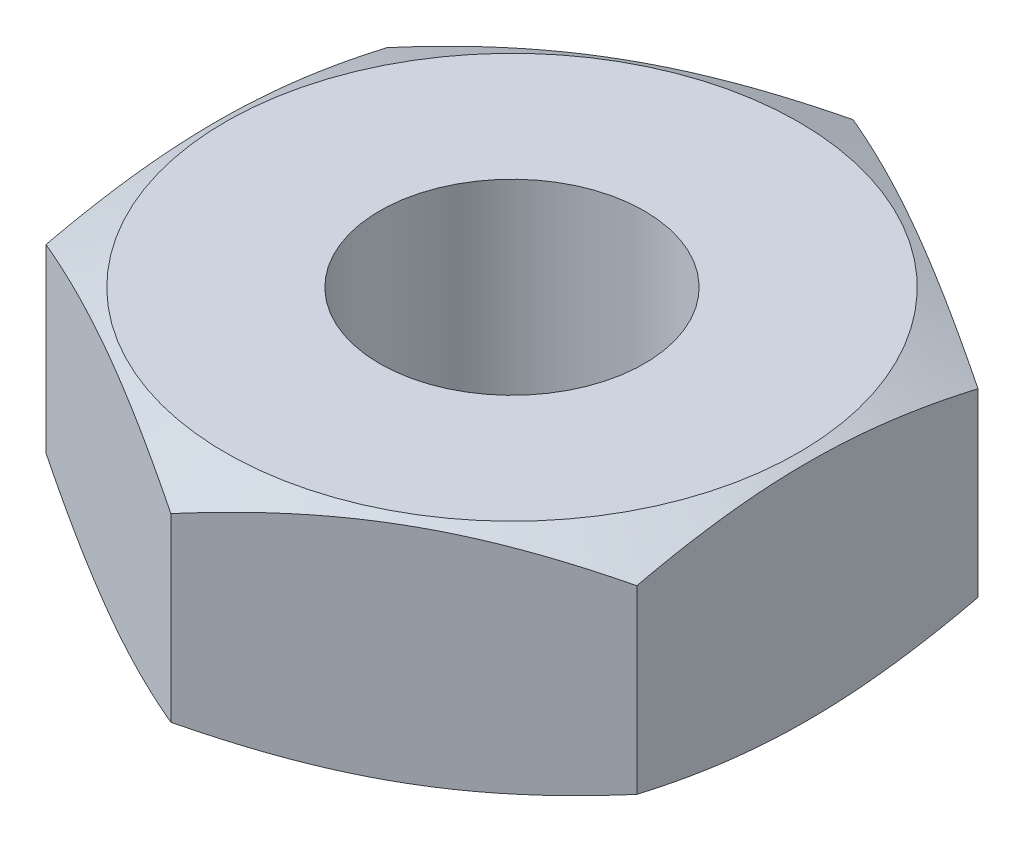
ISO-10303-21;
HEADER;
FILE_DESCRIPTION(('STEP AP214'),'2;1');
FILE_NAME('part.step','',(''),(''),'','','');
FILE_SCHEMA(('AUTOMOTIVE_DESIGN { 1 0 10303 214 1 1 1 1 }'));
ENDSEC;
DATA;
#1=APPLICATION_CONTEXT('core data for automotive mechanical design processes');
#2=APPLICATION_PROTOCOL_DEFINITION('international standard','automotive_design',2000,#1);
#3=PRODUCT_CONTEXT('',#1,'mechanical');
#4=PRODUCT('Part','Part','',(#3));
#5=PRODUCT_RELATED_PRODUCT_CATEGORY('part','',(#4));
#6=PRODUCT_DEFINITION_FORMATION('','',#4);
#7=PRODUCT_DEFINITION_CONTEXT('part definition',#1,'design');
#8=PRODUCT_DEFINITION('design','',#6,#7);
#9=PRODUCT_DEFINITION_SHAPE('','',#8);
#10=(LENGTH_UNIT() NAMED_UNIT(*) SI_UNIT(.MILLI.,.METRE.));
#11=(NAMED_UNIT(*) PLANE_ANGLE_UNIT() SI_UNIT($,.RADIAN.));
#12=(NAMED_UNIT(*) SI_UNIT($,.STERADIAN.) SOLID_ANGLE_UNIT());
#13=UNCERTAINTY_MEASURE_WITH_UNIT(LENGTH_MEASURE(1.E-05),#10,'distance_accuracy_value','');
#14=(GEOMETRIC_REPRESENTATION_CONTEXT(3) GLOBAL_UNCERTAINTY_ASSIGNED_CONTEXT((#13)) GLOBAL_UNIT_ASSIGNED_CONTEXT((#10,
#11,#12)) REPRESENTATION_CONTEXT('',''));
#15=CARTESIAN_POINT('',(0.,0.,0.));
#16=DIRECTION('',(0.,0.,1.));
#17=DIRECTION('',(1.,0.,0.));
#18=AXIS2_PLACEMENT_3D('',#15,#16,#17);
#19=CARTESIAN_POINT('',(3.07958633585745,0.,0.));
#20=DIRECTION('',(0.,-1.,0.));
#21=DIRECTION('',(0.,0.,-1.));
#22=AXIS2_PLACEMENT_3D('',#19,#20,#21);
#23=PLANE('',#22);
#24=CARTESIAN_POINT('',(0.,1.2490009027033E-13,0.));
#25=DIRECTION('',(0.,-1.,0.));
#26=DIRECTION('',(0.,0.,-1.));
#27=AXIS2_PLACEMENT_3D('',#24,#25,#26);
#28=CIRCLE('',#27,3.07958633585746);
#29=CARTESIAN_POINT('',(0.,1.0519894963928E-13,-3.07958633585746));
#30=VERTEX_POINT('',#29);
#31=EDGE_CURVE('E184',#30,#30,#28,.T.);
#32=ORIENTED_EDGE('',*,*,#31,.T.);
#33=EDGE_LOOP('',(#32));
#34=FACE_BOUND('',#33,.T.);
#35=CARTESIAN_POINT('',(0.,1.2490009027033E-13,0.));
#36=DIRECTION('',(0.,-1.,0.));
#37=DIRECTION('',(0.,0.,-1.));
#38=AXIS2_PLACEMENT_3D('',#35,#36,#37);
#39=CIRCLE('',#38,1.4224);
#40=CARTESIAN_POINT('',(0.,1.15800523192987E-13,-1.4224));
#41=VERTEX_POINT('',#40);
#42=EDGE_CURVE('E192',#41,#41,#39,.T.);
#43=ORIENTED_EDGE('',*,*,#42,.F.);
#44=EDGE_LOOP('',(#43));
#45=FACE_BOUND('',#44,.T.);
#46=ADVANCED_FACE('F26',(#34,#45),#23,.T.);
#47=CARTESIAN_POINT('',(0.,-24.8919999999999,-1.11022302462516E-13));
#48=DIRECTION('',(0.,-1.,0.));
#49=DIRECTION('',(0.,0.,-1.));
#50=AXIS2_PLACEMENT_3D('',#47,#48,#49);
#51=CYLINDRICAL_SURFACE('',#50,1.4224);
#52=ORIENTED_EDGE('',*,*,#42,.T.);
#53=EDGE_LOOP('',(#52));
#54=FACE_BOUND('',#53,.T.);
#55=CARTESIAN_POINT('',(-1.38777878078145E-13,2.48920000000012,2.77555756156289E-13));
#56=DIRECTION('',(0.,-1.,0.));
#57=DIRECTION('',(0.,0.,-1.));
#58=AXIS2_PLACEMENT_3D('',#55,#56,#57);
#59=CIRCLE('',#58,1.4224);
#60=CARTESIAN_POINT('',(-1.38383082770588E-13,2.48920000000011,-1.42239999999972));
#61=VERTEX_POINT('',#60);
#62=EDGE_CURVE('E190',#61,#61,#59,.T.);
#63=ORIENTED_EDGE('',*,*,#62,.F.);
#64=EDGE_LOOP('',(#63));
#65=FACE_BOUND('',#64,.T.);
#66=ADVANCED_FACE('F222',(#54,#65),#51,.F.);
#67=CARTESIAN_POINT('',(1.42239999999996,2.48920000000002,3.05311331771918E-13));
#68=DIRECTION('',(0.,1.,0.));
#69=DIRECTION('',(0.,0.,1.));
#70=AXIS2_PLACEMENT_3D('',#67,#68,#69);
#71=PLANE('',#70);
#72=ORIENTED_EDGE('',*,*,#62,.T.);
#73=EDGE_LOOP('',(#72));
#74=FACE_BOUND('',#73,.T.);
#75=CARTESIAN_POINT('',(-1.38777878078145E-13,2.48920000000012,2.77555756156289E-13));
#76=DIRECTION('',(0.,-1.,0.));
#77=DIRECTION('',(0.,0.,-1.));
#78=AXIS2_PLACEMENT_3D('',#75,#76,#77);
#79=CIRCLE('',#78,3.07958633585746);
#80=CARTESIAN_POINT('',(-1.37923121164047E-13,2.4892000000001,-3.07958633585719));
#81=VERTEX_POINT('',#80);
#82=EDGE_CURVE('E187',#81,#81,#79,.T.);
#83=ORIENTED_EDGE('',*,*,#82,.F.);
#84=EDGE_LOOP('',(#83));
#85=FACE_BOUND('',#84,.T.);
#86=ADVANCED_FACE('F227',(#74,#85),#71,.T.);
#87=CARTESIAN_POINT('',(-1.38777878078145E-13,2.21566958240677,2.77555756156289E-13));
#88=DIRECTION('',(0.,-1.,0.));
#89=DIRECTION('',(0.,0.,-1.));
#90=AXIS2_PLACEMENT_3D('',#87,#88,#89);
#91=CONICAL_SURFACE('',#90,3.66617420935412,1.1344640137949);
#92=CARTESIAN_POINT('',(3.17499999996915,1.22054135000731,-4.85407918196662));
#93=CARTESIAN_POINT('',(3.17499999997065,1.27618918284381,-4.71143932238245));
#94=CARTESIAN_POINT('',(3.17499999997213,1.33122756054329,-4.56855720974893));
#95=CARTESIAN_POINT('',(3.17499999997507,1.43973966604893,-4.28217998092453));
#96=CARTESIAN_POINT('',(3.17499999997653,1.49321319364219,-4.13868478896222));
#97=CARTESIAN_POINT('',(3.17499999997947,1.59841400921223,-3.85050019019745));
#98=CARTESIAN_POINT('',(3.17499999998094,1.65013474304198,-3.70580838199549));
#99=CARTESIAN_POINT('',(3.17499999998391,1.75114634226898,-3.41558149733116));
#100=CARTESIAN_POINT('',(3.17499999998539,1.80043729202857,-3.27004645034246));
#101=CARTESIAN_POINT('',(3.17499999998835,1.89532487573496,-2.97991427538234));
#102=CARTESIAN_POINT('',(3.17499999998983,1.94096194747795,-2.83533044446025));
#103=CARTESIAN_POINT('',(3.17499999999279,2.02847202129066,-2.54503070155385));
#104=CARTESIAN_POINT('',(3.17499999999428,2.07034525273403,-2.39931485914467));
#105=CARTESIAN_POINT('',(3.17499999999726,2.14930113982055,-2.10672082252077));
#106=CARTESIAN_POINT('',(3.17499999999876,2.18638822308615,-1.95984383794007));
#107=CARTESIAN_POINT('',(3.17500000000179,2.25460851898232,-1.66473138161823));
#108=CARTESIAN_POINT('',(3.17500000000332,2.28574256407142,-1.51649610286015));
#109=CARTESIAN_POINT('',(3.17500000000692,2.35072345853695,-1.16414340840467));
#110=CARTESIAN_POINT('',(3.17500000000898,2.3814006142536,-0.959409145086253));
#111=CARTESIAN_POINT('',(3.17500000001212,2.41462996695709,-0.650994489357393));
#112=CARTESIAN_POINT('',(3.17500000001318,2.42357502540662,-0.547984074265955));
#113=CARTESIAN_POINT('',(3.17500000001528,2.43692069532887,-0.341673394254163));
#114=CARTESIAN_POINT('',(3.17500000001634,2.4413218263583,-0.238373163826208));
#115=CARTESIAN_POINT('',(3.17500000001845,2.445426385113,-0.0312268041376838));
#116=CARTESIAN_POINT('',(3.17500000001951,2.44510916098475,0.0726197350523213));
#117=CARTESIAN_POINT('',(3.17500000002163,2.43973997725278,0.280181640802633));
#118=CARTESIAN_POINT('',(3.17500000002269,2.43468834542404,0.383897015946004));
#119=CARTESIAN_POINT('',(3.1750000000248,2.42003199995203,0.591025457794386));
#120=CARTESIAN_POINT('',(3.17500000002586,2.41042630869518,0.694438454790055));
#121=CARTESIAN_POINT('',(3.17500000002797,2.3869849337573,0.900771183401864));
#122=CARTESIAN_POINT('',(3.17500000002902,2.37314938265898,1.00369093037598));
#123=CARTESIAN_POINT('',(3.17500000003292,2.31471623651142,1.38452665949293));
#124=CARTESIAN_POINT('',(3.17500000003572,2.25798338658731,1.66061773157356));
#125=CARTESIAN_POINT('',(3.17500000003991,2.1583946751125,2.07113252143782));
#126=CARTESIAN_POINT('',(3.1750000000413,2.12275584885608,2.20745393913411));
#127=CARTESIAN_POINT('',(3.17500000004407,2.04755889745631,2.47901724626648));
#128=CARTESIAN_POINT('',(3.17500000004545,2.00800101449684,2.6142592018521));
#129=CARTESIAN_POINT('',(3.17500000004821,1.9255107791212,2.88451676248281));
#130=CARTESIAN_POINT('',(3.17500000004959,1.88256096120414,3.01952697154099));
#131=CARTESIAN_POINT('',(3.17500000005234,1.79409512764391,3.28870656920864));
#132=CARTESIAN_POINT('',(3.17500000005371,1.74857902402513,3.42287592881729));
#133=CARTESIAN_POINT('',(3.1750000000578,1.60899614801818,3.82416872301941));
#134=CARTESIAN_POINT('',(3.17500000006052,1.51185020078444,4.09021905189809));
#135=CARTESIAN_POINT('',(3.17500000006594,1.31175651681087,4.62120769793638));
#136=CARTESIAN_POINT('',(3.17500000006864,1.20878898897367,4.88613846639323));
#137=CARTESIAN_POINT('',(3.17500000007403,0.999046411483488,5.41452447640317));
#138=CARTESIAN_POINT('',(3.17500000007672,0.892270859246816,5.67797951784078));
#139=CARTESIAN_POINT('',(3.17500000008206,0.677417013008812,6.20041664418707));
#140=CARTESIAN_POINT('',(3.17500000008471,0.569372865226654,6.4594128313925));
#141=CARTESIAN_POINT('',(3.17500000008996,0.351338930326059,6.97651804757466));
#142=CARTESIAN_POINT('',(3.17500000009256,0.241349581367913,7.23462726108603));
#143=CARTESIAN_POINT('',(3.1750000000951,0.130699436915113,7.49244750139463));
#144=B_SPLINE_CURVE_WITH_KNOTS('',3,(#92,#93,#94,#95,#96,#97,#98,#99,#100,#101,#102,#103,#104,
#105,#106,#107,#108,#109,#110,#111,#112,#113,#114,#115,#116,#117,#118,#119,#120,#121,#122,#123,
#124,#125,#126,#127,#128,#129,#130,#131,#132,#133,#134,#135,#136,#137,#138,#139,#140,#141,#142,
#143),.UNSPECIFIED.,.F.,.F.,(4,2,2,2,2,2,2,2,2,2,2,2,2,2,2,2,2,2,2,2,2,2,2,2,2,4),(0.,
0.459336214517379,0.918730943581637,1.37968734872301,1.84062773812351,2.2954332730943,
2.75021107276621,3.20456509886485,3.65885554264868,4.27923488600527,4.58934471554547,
4.89941908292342,5.21085101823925,5.52226139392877,5.83373864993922,6.14520614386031,
6.98949562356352,7.41218620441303,7.83485068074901,8.25985456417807,8.68487302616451,
9.53446313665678,10.3871390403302,11.239927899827,12.0818059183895,12.9234966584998),.UNSPECIFIED.);
#145=CARTESIAN_POINT('',(3.17500000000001,2.21566958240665,-1.83308710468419));
#146=VERTEX_POINT('',#145);
#147=CARTESIAN_POINT('',(3.17500000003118,2.21566958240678,1.83308710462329));
#148=VERTEX_POINT('',#147);
#149=EDGE_CURVE('E176',#146,#148,#144,.T.);
#150=ORIENTED_EDGE('',*,*,#149,.F.);
#151=CARTESIAN_POINT('',(-0.000200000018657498,2.21561573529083,-3.66628967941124));
#152=CARTESIAN_POINT('',(0.0958205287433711,2.24146788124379,-3.61085220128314));
#153=CARTESIAN_POINT('',(0.192195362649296,2.26565998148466,-3.55521016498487));
#154=CARTESIAN_POINT('',(0.385668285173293,2.31014782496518,-3.4435085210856));
#155=CARTESIAN_POINT('',(0.482766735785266,2.33044146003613,-3.38744870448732));
#156=CARTESIAN_POINT('',(0.677689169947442,2.36654386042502,-3.27491018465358));
#157=CARTESIAN_POINT('',(0.775513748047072,2.38234840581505,-3.21843113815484));
#158=CARTESIAN_POINT('',(0.971664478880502,2.40888922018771,-3.10518346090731));
#159=CARTESIAN_POINT('',(1.06999053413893,2.41962643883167,-3.04841488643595));
#160=CARTESIAN_POINT('',(1.26493848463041,2.43543943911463,-2.93586163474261));
#161=CARTESIAN_POINT('',(1.36155343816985,2.44062800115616,-2.8800809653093));
#162=CARTESIAN_POINT('',(1.55489483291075,2.44551688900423,-2.76845525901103));
#163=CARTESIAN_POINT('',(1.65162128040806,2.44521688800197,-2.71261021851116));
#164=CARTESIAN_POINT('',(1.84485278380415,2.43914377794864,-2.60104795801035));
#165=CARTESIAN_POINT('',(1.94135796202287,2.43337577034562,-2.54533066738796));
#166=CARTESIAN_POINT('',(2.13401570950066,2.41661500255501,-2.43409966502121));
#167=CARTESIAN_POINT('',(2.23016831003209,2.4056227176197,-2.37858593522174));
#168=CARTESIAN_POINT('',(2.39719776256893,2.38229383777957,-2.2821514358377));
#169=CARTESIAN_POINT('',(2.46819033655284,2.37103724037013,-2.24116385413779));
#170=CARTESIAN_POINT('',(2.60985089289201,2.34609260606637,-2.15937609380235));
#171=CARTESIAN_POINT('',(2.68051888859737,2.33240467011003,-2.11857590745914));
#172=CARTESIAN_POINT('',(2.82207640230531,2.30270182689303,-2.03684763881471));
#173=CARTESIAN_POINT('',(2.89296307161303,2.28666895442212,-1.99592120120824));
#174=CARTESIAN_POINT('',(3.03436150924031,2.25259287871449,-1.91428477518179));
#175=CARTESIAN_POINT('',(3.10487333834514,2.23455001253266,-1.87357475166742));
#176=CARTESIAN_POINT('',(3.17520000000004,2.21561573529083,-1.83297163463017));
#177=B_SPLINE_CURVE_WITH_KNOTS('',3,(#151,#152,#153,#154,#155,#156,#157,#158,#159,#160,#161,
#162,#163,#164,#165,#166,#167,#168,#169,#170,#171,#172,#173,#174,#175,#176),.UNSPECIFIED.,.F.,
.F.,(4,2,2,2,2,2,2,2,2,2,2,2,4),(0.,0.34156632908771,0.683316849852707,1.02538757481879,
1.36739416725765,1.70230880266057,2.03724338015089,2.37186578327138,2.70645775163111,
2.95465467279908,3.20284129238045,3.45303996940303,3.70319675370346),.UNSPECIFIED.);
#178=CARTESIAN_POINT('',(-1.87350135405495E-11,2.21566958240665,-3.66617420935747));
#179=VERTEX_POINT('',#178);
#180=EDGE_CURVE('E171',#179,#146,#177,.T.);
#181=ORIENTED_EDGE('',*,*,#180,.F.);
#182=CARTESIAN_POINT('',(-3.17520000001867,2.21561573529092,-1.8329716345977));
#183=CARTESIAN_POINT('',(-3.07917947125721,2.2414678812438,-1.88840911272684));
#184=CARTESIAN_POINT('',(-2.98280463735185,2.26565998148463,-1.94405114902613));
#185=CARTESIAN_POINT('',(-2.78933171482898,2.31014782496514,-2.0557527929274));
#186=CARTESIAN_POINT('',(-2.69223326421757,2.3304414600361,-2.11181260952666));
#187=CARTESIAN_POINT('',(-2.49731083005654,2.366543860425,-2.22435112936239));
#188=CARTESIAN_POINT('',(-2.39948625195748,2.38234840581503,-2.28083017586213));
#189=CARTESIAN_POINT('',(-2.2033355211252,2.40888922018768,-2.39407785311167));
#190=CARTESIAN_POINT('',(-2.10500946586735,2.41962643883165,-2.45084642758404));
#191=CARTESIAN_POINT('',(-1.91006151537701,2.43543943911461,-2.56339967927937));
#192=CARTESIAN_POINT('',(-1.81344656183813,2.44062800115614,-2.61918034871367));
#193=CARTESIAN_POINT('',(-1.62010516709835,2.4455168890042,-2.73080605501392));
#194=CARTESIAN_POINT('',(-1.5233787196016,2.44521688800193,-2.78665109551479));
#195=CARTESIAN_POINT('',(-1.33014721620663,2.43914377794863,-2.89821335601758));
#196=CARTESIAN_POINT('',(-1.23364203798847,2.43337577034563,-2.95393064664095));
#197=CARTESIAN_POINT('',(-1.0409842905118,2.41661500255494,-3.06516164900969));
#198=CARTESIAN_POINT('',(-0.944831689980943,2.40562271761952,-3.12067537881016));
#199=CARTESIAN_POINT('',(-0.777802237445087,2.38229383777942,-3.2171098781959));
#200=CARTESIAN_POINT('',(-0.706809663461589,2.37103724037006,-3.25809745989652));
#201=CARTESIAN_POINT('',(-0.56514910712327,2.34609260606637,-3.33988522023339));
#202=CARTESIAN_POINT('',(-0.494481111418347,2.33240467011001,-3.38068540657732));
#203=CARTESIAN_POINT('',(-0.352923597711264,2.30270182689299,-3.46241367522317));
#204=CARTESIAN_POINT('',(-0.282036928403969,2.28666895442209,-3.50334011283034));
#205=CARTESIAN_POINT('',(-0.14063849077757,2.25259287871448,-3.58497653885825));
#206=CARTESIAN_POINT('',(-0.0701266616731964,2.23455001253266,-3.62568656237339));
#207=CARTESIAN_POINT('',(0.000199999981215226,2.21561573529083,-3.66628967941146));
#208=B_SPLINE_CURVE_WITH_KNOTS('',3,(#182,#183,#184,#185,#186,#187,#188,#189,#190,#191,#192,
#193,#194,#195,#196,#197,#198,#199,#200,#201,#202,#203,#204,#205,#206,#207),.UNSPECIFIED.,.F.,
.F.,(4,2,2,2,2,2,2,2,2,2,2,2,4),(0.,0.341566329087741,0.683316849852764,1.02538757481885,
1.36739416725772,1.70230880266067,2.03724338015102,2.37186578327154,2.70645775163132,
2.95465467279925,3.20284129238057,3.4530399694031,3.70319675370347),.UNSPECIFIED.);
#209=CARTESIAN_POINT('',(-3.1750000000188,2.21566958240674,-1.83308710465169));
#210=VERTEX_POINT('',#209);
#211=EDGE_CURVE('E102',#210,#179,#208,.T.);
#212=ORIENTED_EDGE('',*,*,#211,.F.);
#213=CARTESIAN_POINT('',(-3.17500000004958,1.22054135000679,-4.8540791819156));
#214=CARTESIAN_POINT('',(-3.17500000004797,1.27618918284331,-4.71143932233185));
#215=CARTESIAN_POINT('',(-3.17500000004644,1.33122756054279,-4.56855720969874));
#216=CARTESIAN_POINT('',(-3.17500000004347,1.43973966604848,-4.28217998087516));
#217=CARTESIAN_POINT('',(-3.17500000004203,1.49321319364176,-4.13868478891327));
#218=CARTESIAN_POINT('',(-3.1750000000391,1.5984140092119,-3.85050019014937));
#219=CARTESIAN_POINT('',(-3.17500000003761,1.65013474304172,-3.70580838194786));
#220=CARTESIAN_POINT('',(-3.17500000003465,1.7511463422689,-3.41558149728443));
#221=CARTESIAN_POINT('',(-3.17500000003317,1.80043729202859,-3.27004645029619));
#222=CARTESIAN_POINT('',(-3.1750000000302,1.89532487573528,-2.97991427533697));
#223=CARTESIAN_POINT('',(-3.17500000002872,1.94096194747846,-2.8353304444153));
#224=CARTESIAN_POINT('',(-3.17500000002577,2.0284720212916,-2.54503070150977));
#225=CARTESIAN_POINT('',(-3.17500000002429,2.07034525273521,-2.39931485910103));
#226=CARTESIAN_POINT('',(-3.17500000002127,2.14930113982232,-2.10672082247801));
#227=CARTESIAN_POINT('',(-3.17500000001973,2.18638822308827,-1.95984383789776));
#228=CARTESIAN_POINT('',(-3.17500000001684,2.25460851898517,-1.66473138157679));
#229=CARTESIAN_POINT('',(-3.1750000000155,2.28574256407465,-1.51649610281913));
#230=CARTESIAN_POINT('',(-3.17500000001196,2.3507234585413,-1.16414340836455));
#231=CARTESIAN_POINT('',(-3.17500000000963,2.38140061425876,-0.959409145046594));
#232=CARTESIAN_POINT('',(-3.1750000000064,2.41462996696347,-0.65099448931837));
#233=CARTESIAN_POINT('',(-3.17500000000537,2.4235750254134,-0.547984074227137));
#234=CARTESIAN_POINT('',(-3.17500000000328,2.43692069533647,-0.341673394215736));
#235=CARTESIAN_POINT('',(-3.17500000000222,2.44132182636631,-0.238373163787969));
#236=CARTESIAN_POINT('',(-3.1750000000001,2.44542638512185,-0.0312268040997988));
#237=CARTESIAN_POINT('',(-3.17499999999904,2.44510916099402,0.0726197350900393));
#238=CARTESIAN_POINT('',(-3.17499999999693,2.43973997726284,0.280181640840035));
#239=CARTESIAN_POINT('',(-3.17499999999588,2.43468834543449,0.383897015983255));
#240=CARTESIAN_POINT('',(-3.17499999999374,2.42003199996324,0.591025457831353));
#241=CARTESIAN_POINT('',(-3.17499999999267,2.41042630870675,0.694438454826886));
#242=CARTESIAN_POINT('',(-3.17499999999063,2.38698493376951,0.900771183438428));
#243=CARTESIAN_POINT('',(-3.17499999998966,2.37314938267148,1.00369093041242));
#244=CARTESIAN_POINT('',(-3.17499999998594,2.31471623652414,1.38452665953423));
#245=CARTESIAN_POINT('',(-3.17499999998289,2.2579833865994,1.6606177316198));
#246=CARTESIAN_POINT('',(-3.17499999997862,2.15839467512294,2.07113252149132));
#247=CARTESIAN_POINT('',(-3.17499999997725,2.12275584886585,2.20745393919));
#248=CARTESIAN_POINT('',(-3.17499999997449,2.04755889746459,2.47901724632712));
#249=CARTESIAN_POINT('',(-3.17499999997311,2.00800101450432,2.61425920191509));
#250=CARTESIAN_POINT('',(-3.17499999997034,1.92551077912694,2.88451676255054));
#251=CARTESIAN_POINT('',(-3.17499999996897,1.88256096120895,3.01952697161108));
#252=CARTESIAN_POINT('',(-3.17499999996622,1.7940951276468,3.28870656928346));
#253=CARTESIAN_POINT('',(-3.17499999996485,1.74857902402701,3.42287592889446));
#254=CARTESIAN_POINT('',(-3.17499999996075,1.60899614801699,3.82416872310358));
#255=CARTESIAN_POINT('',(-3.17499999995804,1.51185020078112,4.09021905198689));
#256=CARTESIAN_POINT('',(-3.17499999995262,1.31175651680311,4.62120769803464));
#257=CARTESIAN_POINT('',(-3.17499999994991,1.20878898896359,4.88613846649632));
#258=CARTESIAN_POINT('',(-3.17499999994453,0.999046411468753,5.4145244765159));
#259=CARTESIAN_POINT('',(-3.17499999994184,0.892270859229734,5.67797951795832));
#260=CARTESIAN_POINT('',(-3.17499999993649,0.677417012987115,6.20041664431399));
#261=CARTESIAN_POINT('',(-3.17499999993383,0.569372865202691,6.45941283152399));
#262=CARTESIAN_POINT('',(-3.17499999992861,0.351338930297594,6.97651804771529));
#263=CARTESIAN_POINT('',(-3.17499999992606,0.241349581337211,7.23462726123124));
#264=CARTESIAN_POINT('',(-3.17499999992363,0.130699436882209,7.49244750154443));
#265=B_SPLINE_CURVE_WITH_KNOTS('',3,(#213,#214,#215,#216,#217,#218,#219,#220,#221,#222,#223,
#224,#225,#226,#227,#228,#229,#230,#231,#232,#233,#234,#235,#236,#237,#238,#239,#240,#241,#242,
#243,#244,#245,#246,#247,#248,#249,#250,#251,#252,#253,#254,#255,#256,#257,#258,#259,#260,#261,
#262,#263,#264),.UNSPECIFIED.,.F.,.F.,(4,2,2,2,2,2,2,2,2,2,2,2,2,2,2,2,2,2,2,2,2,2,2,2,2,4),(0.,
0.459336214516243,0.918730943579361,1.37968734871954,1.84062773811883,2.29543327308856,
2.75021107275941,3.20456509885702,3.65885554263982,4.27923488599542,4.58934471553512,
4.89941908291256,5.21085101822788,5.5222613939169,5.83373864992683,6.14520614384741,
6.98949562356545,7.41218620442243,7.83485068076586,8.25985456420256,8.68487302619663,
9.53446313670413,10.3871390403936,11.2399278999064,12.0818059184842,12.9234966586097),.UNSPECIFIED.);
#266=CARTESIAN_POINT('',(-3.17499999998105,2.21566958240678,1.833087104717));
#267=VERTEX_POINT('',#266);
#268=EDGE_CURVE('E100',#267,#210,#265,.F.);
#269=ORIENTED_EDGE('',*,*,#268,.F.);
#270=CARTESIAN_POINT('',(0.000200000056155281,2.21561573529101,3.66628967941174));
#271=CARTESIAN_POINT('',(-0.0958205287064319,2.24146788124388,3.61085220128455));
#272=CARTESIAN_POINT('',(-0.192195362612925,2.26565998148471,3.55521016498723));
#273=CARTESIAN_POINT('',(-0.385668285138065,2.31014782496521,3.44350852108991));
#274=CARTESIAN_POINT('',(-0.482766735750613,2.33044146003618,3.38744870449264));
#275=CARTESIAN_POINT('',(-0.677689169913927,2.36654386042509,3.2749101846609));
#276=CARTESIAN_POINT('',(-0.775513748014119,2.38234840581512,3.21843113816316));
#277=CARTESIAN_POINT('',(-0.971664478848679,2.40888922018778,3.10518346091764));
#278=CARTESIAN_POINT('',(-1.06999053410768,2.41962643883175,3.04841488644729));
#279=CARTESIAN_POINT('',(-1.2649384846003,2.43543943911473,2.93586163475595));
#280=CARTESIAN_POINT('',(-1.36155343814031,2.44062800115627,2.88008096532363));
#281=CARTESIAN_POINT('',(-1.55489483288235,2.44551688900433,2.76845525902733));
#282=CARTESIAN_POINT('',(-1.65162128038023,2.44521688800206,2.71261021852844));
#283=CARTESIAN_POINT('',(-1.84485278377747,2.43914377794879,2.6010479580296));
#284=CARTESIAN_POINT('',(-1.94135796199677,2.43337577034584,2.5453306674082));
#285=CARTESIAN_POINT('',(-2.13401570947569,2.41661500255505,2.4340996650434));
#286=CARTESIAN_POINT('',(-2.23016831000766,2.40562271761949,2.37858593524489));
#287=CARTESIAN_POINT('',(-2.39719776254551,2.38229383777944,2.28215143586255));
#288=CARTESIAN_POINT('',(-2.46819033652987,2.3710372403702,2.24116385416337));
#289=CARTESIAN_POINT('',(-2.60985089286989,2.34609260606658,2.15937609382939));
#290=CARTESIAN_POINT('',(-2.68051888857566,2.33240467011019,2.11857590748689));
#291=CARTESIAN_POINT('',(-2.82207640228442,2.30270182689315,2.03684763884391));
#292=CARTESIAN_POINT('',(-2.89296307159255,2.28666895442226,1.99592120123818));
#293=CARTESIAN_POINT('',(-3.03436150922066,2.25259287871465,1.91428477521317));
#294=CARTESIAN_POINT('',(-3.1048733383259,2.23455001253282,1.87357475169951));
#295=CARTESIAN_POINT('',(-3.1751999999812,2.21561573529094,1.83297163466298));
#296=B_SPLINE_CURVE_WITH_KNOTS('',3,(#270,#271,#272,#273,#274,#275,#276,#277,#278,#279,#280,
#281,#282,#283,#284,#285,#286,#287,#288,#289,#290,#291,#292,#293,#294,#295),.UNSPECIFIED.,.F.,
.F.,(4,2,2,2,2,2,2,2,2,2,2,2,4),(0.,0.34156632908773,0.683316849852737,1.02538757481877,
1.36739416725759,1.70230880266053,2.03724338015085,2.37186578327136,2.70645775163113,
2.9546546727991,3.20284129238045,3.45303996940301,3.70319675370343),.UNSPECIFIED.);
#297=CARTESIAN_POINT('',(5.62605517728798E-11,2.21566958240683,3.66617420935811));
#298=VERTEX_POINT('',#297);
#299=EDGE_CURVE('E84',#298,#267,#296,.T.);
#300=ORIENTED_EDGE('',*,*,#299,.F.);
#301=CARTESIAN_POINT('',(3.17520000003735,2.21561573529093,1.83297163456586));
#302=CARTESIAN_POINT('',(3.07917947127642,2.24146788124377,1.88840911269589));
#303=CARTESIAN_POINT('',(2.98280463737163,2.26565998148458,1.94405114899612));
#304=CARTESIAN_POINT('',(2.78933171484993,2.31014782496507,2.05575279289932));
#305=CARTESIAN_POINT('',(2.69223326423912,2.33044146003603,2.11181260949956));
#306=CARTESIAN_POINT('',(2.49731083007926,2.36654386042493,2.22435112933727));
#307=CARTESIAN_POINT('',(2.39948625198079,2.38234840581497,2.28083017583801));
#308=CARTESIAN_POINT('',(2.20333552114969,2.40888922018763,2.39407785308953));
#309=CARTESIAN_POINT('',(2.10500946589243,2.4196264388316,2.4508464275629));
#310=CARTESIAN_POINT('',(1.91006151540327,2.43543943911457,2.5633996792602));
#311=CARTESIAN_POINT('',(1.81344656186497,2.4406280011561,2.61918034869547));
#312=CARTESIAN_POINT('',(1.62010516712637,2.44551688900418,2.73080605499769));
#313=CARTESIAN_POINT('',(1.52337871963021,2.44521688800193,2.78665109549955));
#314=CARTESIAN_POINT('',(1.33014721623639,2.43914377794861,2.89821335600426));
#315=CARTESIAN_POINT('',(1.23364203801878,2.43337577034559,2.95393064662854));
#316=CARTESIAN_POINT('',(1.04098429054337,2.41661500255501,3.06516164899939));
#317=CARTESIAN_POINT('',(0.944831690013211,2.40562271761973,3.12067537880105));
#318=CARTESIAN_POINT('',(0.777802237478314,2.3822938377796,3.21710987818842));
#319=CARTESIAN_POINT('',(0.706809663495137,2.37103724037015,3.2580974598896));
#320=CARTESIAN_POINT('',(0.565149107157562,2.34609260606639,3.3398852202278));
#321=CARTESIAN_POINT('',(0.494481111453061,2.33240467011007,3.38068540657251));
#322=CARTESIAN_POINT('',(0.352923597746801,2.30270182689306,3.46241367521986));
#323=CARTESIAN_POINT('',(0.282036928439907,2.28666895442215,3.50334011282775));
#324=CARTESIAN_POINT('',(0.140638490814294,2.25259287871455,3.5849765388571));
#325=CARTESIAN_POINT('',(0.0701266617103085,2.23455001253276,3.62568656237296));
#326=CARTESIAN_POINT('',(-0.000199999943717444,2.21561573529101,3.66628967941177));
#327=B_SPLINE_CURVE_WITH_KNOTS('',3,(#301,#302,#303,#304,#305,#306,#307,#308,#309,#310,#311,
#312,#313,#314,#315,#316,#317,#318,#319,#320,#321,#322,#323,#324,#325,#326),.UNSPECIFIED.,.F.,
.F.,(4,2,2,2,2,2,2,2,2,2,2,2,4),(0.,0.341566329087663,0.683316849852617,1.02538757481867,
1.36739416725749,1.70230880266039,2.03724338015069,2.37186578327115,2.70645775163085,
2.95465467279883,3.2028412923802,3.45303996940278,3.70319675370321),.UNSPECIFIED.);
#328=EDGE_CURVE('E79',#148,#298,#327,.T.);
#329=ORIENTED_EDGE('',*,*,#328,.F.);
#330=EDGE_LOOP('',(#150,#181,#212,#269,#300,#329));
#331=FACE_BOUND('',#330,.T.);
#332=ORIENTED_EDGE('',*,*,#82,.T.);
#333=EDGE_LOOP('',(#332));
#334=FACE_BOUND('',#333,.T.);
#335=ADVANCED_FACE('F97',(#331,#334),#91,.T.);
#336=CARTESIAN_POINT('',(0.,1.2490009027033E-13,0.));
#337=DIRECTION('',(0.,1.,0.));
#338=DIRECTION('',(0.,0.,1.));
#339=AXIS2_PLACEMENT_3D('',#336,#337,#338);
#340=CONICAL_SURFACE('',#339,3.07958633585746,1.1344640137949);
#341=CARTESIAN_POINT('',(3.17499999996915,1.26865864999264,-4.85407918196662));
#342=CARTESIAN_POINT('',(3.17499999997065,1.21301081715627,-4.71143932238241));
#343=CARTESIAN_POINT('',(3.17499999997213,1.15797243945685,-4.56855720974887));
#344=CARTESIAN_POINT('',(3.17499999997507,1.04946033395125,-4.28217998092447));
#345=CARTESIAN_POINT('',(3.17499999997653,0.995986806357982,-4.13868478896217));
#346=CARTESIAN_POINT('',(3.17499999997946,0.890785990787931,-3.85050019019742));
#347=CARTESIAN_POINT('',(3.17499999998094,0.839065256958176,-3.70580838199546));
#348=CARTESIAN_POINT('',(3.1749999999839,0.738053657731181,-3.41558149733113));
#349=CARTESIAN_POINT('',(3.17499999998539,0.688762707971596,-3.27004645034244));
#350=CARTESIAN_POINT('',(3.17499999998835,0.593875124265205,-2.97991427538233));
#351=CARTESIAN_POINT('',(3.17499999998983,0.548238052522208,-2.83533044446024));
#352=CARTESIAN_POINT('',(3.17499999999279,0.460727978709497,-2.54503070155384));
#353=CARTESIAN_POINT('',(3.17499999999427,0.418854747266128,-2.39931485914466));
#354=CARTESIAN_POINT('',(3.17499999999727,0.339898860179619,-2.10672082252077));
#355=CARTESIAN_POINT('',(3.17499999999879,0.302811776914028,-1.95984383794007));
#356=CARTESIAN_POINT('',(3.17500000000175,0.234591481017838,-1.66473138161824));
#357=CARTESIAN_POINT('',(3.17500000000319,0.203457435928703,-1.51649610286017));
#358=CARTESIAN_POINT('',(3.17500000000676,0.138476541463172,-1.16414340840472));
#359=CARTESIAN_POINT('',(3.17500000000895,0.107799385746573,-0.959409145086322));
#360=CARTESIAN_POINT('',(3.17500000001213,0.0745700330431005,-0.650994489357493));
#361=CARTESIAN_POINT('',(3.17500000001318,0.0656249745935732,-0.547984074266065));
#362=CARTESIAN_POINT('',(3.17500000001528,0.0522793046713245,-0.341673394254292));
#363=CARTESIAN_POINT('',(3.17500000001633,0.0478781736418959,-0.238373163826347));
#364=CARTESIAN_POINT('',(3.17500000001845,0.0437736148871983,-0.0312268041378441));
#365=CARTESIAN_POINT('',(3.17500000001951,0.0440908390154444,0.0726197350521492));
#366=CARTESIAN_POINT('',(3.17500000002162,0.0494600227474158,0.280181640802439));
#367=CARTESIAN_POINT('',(3.17500000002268,0.0545116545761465,0.383897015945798));
#368=CARTESIAN_POINT('',(3.17500000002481,0.069168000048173,0.591025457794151));
#369=CARTESIAN_POINT('',(3.17500000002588,0.078773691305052,0.694438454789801));
#370=CARTESIAN_POINT('',(3.17500000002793,0.102215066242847,0.900771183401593));
#371=CARTESIAN_POINT('',(3.17500000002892,0.11605061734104,1.00369093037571));
#372=CARTESIAN_POINT('',(3.17500000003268,0.17448376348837,1.38452665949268));
#373=CARTESIAN_POINT('',(3.17500000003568,0.231216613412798,1.66061773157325));
#374=CARTESIAN_POINT('',(3.17500000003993,0.330805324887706,2.07113252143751));
#375=CARTESIAN_POINT('',(3.1750000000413,0.366444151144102,2.20745393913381));
#376=CARTESIAN_POINT('',(3.17500000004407,0.441641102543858,2.47901724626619));
#377=CARTESIAN_POINT('',(3.17500000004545,0.481198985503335,2.61425920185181));
#378=CARTESIAN_POINT('',(3.17500000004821,0.563689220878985,2.88451676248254));
#379=CARTESIAN_POINT('',(3.17500000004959,0.606639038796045,3.01952697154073));
#380=CARTESIAN_POINT('',(3.17500000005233,0.695104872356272,3.28870656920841));
#381=CARTESIAN_POINT('',(3.1750000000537,0.740620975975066,3.42287592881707));
#382=CARTESIAN_POINT('',(3.1750000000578,0.88020385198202,3.82416872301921));
#383=CARTESIAN_POINT('',(3.17500000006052,0.977349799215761,4.09021905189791));
#384=CARTESIAN_POINT('',(3.17500000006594,1.17744348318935,4.62120769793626));
#385=CARTESIAN_POINT('',(3.17500000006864,1.28041101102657,4.88613846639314));
#386=CARTESIAN_POINT('',(3.17500000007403,1.49015358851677,5.41452447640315));
#387=CARTESIAN_POINT('',(3.17500000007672,1.59692914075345,5.6779795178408));
#388=CARTESIAN_POINT('',(3.17500000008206,1.81178298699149,6.20041664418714));
#389=CARTESIAN_POINT('',(3.1750000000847,1.91982713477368,6.45941283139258));
#390=CARTESIAN_POINT('',(3.17500000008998,2.13786106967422,6.9765180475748));
#391=CARTESIAN_POINT('',(3.1750000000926,2.24785041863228,7.23462726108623));
#392=CARTESIAN_POINT('',(3.17500000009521,2.35850056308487,7.49244750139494));
#393=B_SPLINE_CURVE_WITH_KNOTS('',3,(#341,#342,#343,#344,#345,#346,#347,#348,#349,#350,#351,
#352,#353,#354,#355,#356,#357,#358,#359,#360,#361,#362,#363,#364,#365,#366,#367,#368,#369,#370,
#371,#372,#373,#374,#375,#376,#377,#378,#379,#380,#381,#382,#383,#384,#385,#386,#387,#388,#389,
#390,#391,#392),.UNSPECIFIED.,.F.,.F.,(4,2,2,2,2,2,2,2,2,2,2,2,2,2,2,2,2,2,2,2,2,2,2,2,2,4),(0.,
0.459336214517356,0.918730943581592,1.37968734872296,1.84062773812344,2.29543327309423,
2.75021107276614,3.20456509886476,3.65885554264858,4.2792348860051,4.58934471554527,
4.89941908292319,5.21085101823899,5.52226139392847,5.83373864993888,6.14520614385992,
6.98949562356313,7.41218620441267,7.83485068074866,8.25985456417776,8.68487302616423,
9.53446313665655,10.3871390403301,11.239927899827,12.0818059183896,12.9234966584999),.UNSPECIFIED.);
#394=CARTESIAN_POINT('',(3.17500000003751,0.273530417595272,1.83308710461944));
#395=VERTEX_POINT('',#394);
#396=CARTESIAN_POINT('',(3.17500000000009,0.273530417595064,-1.83308710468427));
#397=VERTEX_POINT('',#396);
#398=EDGE_CURVE('E11',#395,#397,#393,.F.);
#399=ORIENTED_EDGE('',*,*,#398,.F.);
#400=CARTESIAN_POINT('',(-0.000199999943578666,0.273584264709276,3.66628967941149));
#401=CARTESIAN_POINT('',(0.0958205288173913,0.247732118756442,3.61085220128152));
#402=CARTESIAN_POINT('',(0.192195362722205,0.223540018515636,3.55521016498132));
#403=CARTESIAN_POINT('',(0.385668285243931,0.17905217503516,3.44350852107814));
#404=CARTESIAN_POINT('',(0.482766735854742,0.158758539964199,3.38744870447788));
#405=CARTESIAN_POINT('',(0.677689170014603,0.122656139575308,3.27491018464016));
#406=CARTESIAN_POINT('',(0.775513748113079,0.106851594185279,3.21843113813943));
#407=CARTESIAN_POINT('',(0.971664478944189,0.0803107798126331,3.1051834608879));
#408=CARTESIAN_POINT('',(1.06999053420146,0.0695735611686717,3.04841488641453));
#409=CARTESIAN_POINT('',(1.26493848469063,0.0537605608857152,2.93586163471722));
#410=CARTESIAN_POINT('',(1.36155343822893,0.0485719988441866,2.88008096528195));
#411=CARTESIAN_POINT('',(1.55489483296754,0.0436831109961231,2.76845525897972));
#412=CARTESIAN_POINT('',(1.65162128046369,0.0439831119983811,2.71261021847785));
#413=CARTESIAN_POINT('',(1.84485278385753,0.0500562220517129,2.60104795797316));
#414=CARTESIAN_POINT('',(1.94135796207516,0.0558242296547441,2.5453306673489));
#415=CARTESIAN_POINT('',(2.13401570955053,0.0725849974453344,2.43409966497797));
#416=CARTESIAN_POINT('',(2.23016831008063,0.083577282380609,2.3785859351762));
#417=CARTESIAN_POINT('',(2.39719776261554,0.10690616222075,2.28215143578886));
#418=CARTESIAN_POINT('',(2.46819033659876,0.118162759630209,2.24116385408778));
#419=CARTESIAN_POINT('',(2.60985089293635,0.143107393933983,2.15937609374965));
#420=CARTESIAN_POINT('',(2.68051888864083,0.156795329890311,2.11857590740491));
#421=CARTESIAN_POINT('',(2.82207640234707,0.186498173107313,2.03684763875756));
#422=CARTESIAN_POINT('',(2.89296307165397,0.202531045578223,1.99592120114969));
#423=CARTESIAN_POINT('',(3.03436150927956,0.236607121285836,1.91428477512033));
#424=CARTESIAN_POINT('',(3.10487333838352,0.254649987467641,1.87357475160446));
#425=CARTESIAN_POINT('',(3.17520000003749,0.273584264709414,1.83297163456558));
#426=B_SPLINE_CURVE_WITH_KNOTS('',3,(#400,#401,#402,#403,#404,#405,#406,#407,#408,#409,#410,
#411,#412,#413,#414,#415,#416,#417,#418,#419,#420,#421,#422,#423,#424,#425),.UNSPECIFIED.,.F.,
.F.,(4,2,2,2,2,2,2,2,2,2,2,2,4),(0.,0.341566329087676,0.683316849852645,1.02538757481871,
1.36739416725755,1.70230880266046,2.03724338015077,2.37186578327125,2.70645775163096,
2.95465467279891,3.20284129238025,3.45303996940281,3.70319675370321),.UNSPECIFIED.);
#427=CARTESIAN_POINT('',(6.23390228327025E-11,0.273530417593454,3.66617420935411));
#428=VERTEX_POINT('',#427);
#429=EDGE_CURVE('E135',#428,#395,#426,.T.);
#430=ORIENTED_EDGE('',*,*,#429,.F.);
#431=CARTESIAN_POINT('',(-3.17519999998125,0.273584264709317,1.83297163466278));
#432=CARTESIAN_POINT('',(-3.07917947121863,0.247732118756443,1.88840911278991));
#433=CARTESIAN_POINT('',(-2.98280463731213,0.223540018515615,1.94405114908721));
#434=CARTESIAN_POINT('',(-2.78933171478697,0.179052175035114,2.05575279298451));
#435=CARTESIAN_POINT('',(-2.69223326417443,0.158758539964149,2.1118126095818));
#436=CARTESIAN_POINT('',(-2.49731083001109,0.122656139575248,2.22435112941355));
#437=CARTESIAN_POINT('',(-2.39948625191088,0.106851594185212,2.2808301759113));
#438=CARTESIAN_POINT('',(-2.20333552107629,0.0803107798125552,2.39407785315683));
#439=CARTESIAN_POINT('',(-2.10500946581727,0.0695735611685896,2.4508464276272));
#440=CARTESIAN_POINT('',(-1.91006151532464,0.0537605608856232,2.56339967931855));
#441=CARTESIAN_POINT('',(-1.81344656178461,0.0485719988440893,2.61918034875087));
#442=CARTESIAN_POINT('',(-1.62010516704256,0.0436831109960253,2.73080605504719));
#443=CARTESIAN_POINT('',(-1.52337871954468,0.0439831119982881,2.78665109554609));
#444=CARTESIAN_POINT('',(-1.33014721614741,0.0500562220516,2.89821335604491));
#445=CARTESIAN_POINT('',(-1.2336420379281,0.0558242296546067,2.95393064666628));
#446=CARTESIAN_POINT('',(-1.0409842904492,0.0725849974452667,3.06516164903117));
#447=CARTESIAN_POINT('',(-0.944831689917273,0.0835772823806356,3.12067537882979));
#448=CARTESIAN_POINT('',(-0.777802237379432,0.106906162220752,3.21710987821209));
#449=CARTESIAN_POINT('',(-0.706809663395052,0.11816275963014,3.25809745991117));
#450=CARTESIAN_POINT('',(-0.565149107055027,0.143107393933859,3.33988522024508));
#451=CARTESIAN_POINT('',(-0.49448111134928,0.156795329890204,3.38068540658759));
#452=CARTESIAN_POINT('',(-0.352923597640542,0.186498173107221,3.46241367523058));
#453=CARTESIAN_POINT('',(-0.282036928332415,0.202531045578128,3.5033401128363));
#454=CARTESIAN_POINT('',(-0.140638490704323,0.236607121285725,3.58497653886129));
#455=CARTESIAN_POINT('',(-0.07012666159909,0.254649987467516,3.62568656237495));
#456=CARTESIAN_POINT('',(0.000200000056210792,0.273584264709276,3.66628967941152));
#457=B_SPLINE_CURVE_WITH_KNOTS('',3,(#431,#432,#433,#434,#435,#436,#437,#438,#439,#440,#441,
#442,#443,#444,#445,#446,#447,#448,#449,#450,#451,#452,#453,#454,#455,#456),.UNSPECIFIED.,.F.,
.F.,(4,2,2,2,2,2,2,2,2,2,2,2,4),(0.,0.341566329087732,0.68331684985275,1.02538757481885,
1.36739416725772,1.70230880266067,2.03724338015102,2.37186578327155,2.70645775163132,
2.95465467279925,3.20284129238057,3.4530399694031,3.70319675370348),.UNSPECIFIED.);
#458=CARTESIAN_POINT('',(-3.17499999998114,0.273530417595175,1.83308710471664));
#459=VERTEX_POINT('',#458);
#460=EDGE_CURVE('E92',#459,#428,#457,.T.);
#461=ORIENTED_EDGE('',*,*,#460,.F.);
#462=CARTESIAN_POINT('',(-3.17500000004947,1.26865864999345,-4.85407918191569));
#463=CARTESIAN_POINT('',(-3.17500000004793,1.21301081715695,-4.71143932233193));
#464=CARTESIAN_POINT('',(-3.17500000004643,1.15797243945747,-4.56855720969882));
#465=CARTESIAN_POINT('',(-3.17500000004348,1.04946033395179,-4.28217998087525));
#466=CARTESIAN_POINT('',(-3.17500000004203,0.995986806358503,-4.13868478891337));
#467=CARTESIAN_POINT('',(-3.17500000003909,0.89078599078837,-3.85050019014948));
#468=CARTESIAN_POINT('',(-3.17500000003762,0.83906525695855,-3.70580838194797));
#469=CARTESIAN_POINT('',(-3.17500000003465,0.738053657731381,-3.41558149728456));
#470=CARTESIAN_POINT('',(-3.17500000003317,0.688762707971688,-3.27004645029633));
#471=CARTESIAN_POINT('',(-3.17500000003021,0.593875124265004,-2.97991427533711));
#472=CARTESIAN_POINT('',(-3.17500000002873,0.548238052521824,-2.83533044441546));
#473=CARTESIAN_POINT('',(-3.17500000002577,0.460727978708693,-2.54503070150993));
#474=CARTESIAN_POINT('',(-3.17500000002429,0.418854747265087,-2.39931485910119));
#475=CARTESIAN_POINT('',(-3.17500000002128,0.339898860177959,-2.10672082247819));
#476=CARTESIAN_POINT('',(-3.17500000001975,0.302811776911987,-1.95984383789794));
#477=CARTESIAN_POINT('',(-3.17500000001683,0.234591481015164,-1.66473138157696));
#478=CARTESIAN_POINT('',(-3.17500000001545,0.203457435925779,-1.51649610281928));
#479=CARTESIAN_POINT('',(-3.17500000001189,0.138476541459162,-1.16414340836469));
#480=CARTESIAN_POINT('',(-3.17500000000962,0.107799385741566,-0.959409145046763));
#481=CARTESIAN_POINT('',(-3.17500000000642,0.0745700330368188,-0.650994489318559));
#482=CARTESIAN_POINT('',(-3.17500000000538,0.065624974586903,-0.547984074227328));
#483=CARTESIAN_POINT('',(-3.17500000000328,0.0522793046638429,-0.341673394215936));
#484=CARTESIAN_POINT('',(-3.17500000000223,0.0478781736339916,-0.238373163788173));
#485=CARTESIAN_POINT('',(-3.17500000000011,0.0437736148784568,-0.0312268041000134));
#486=CARTESIAN_POINT('',(-3.17499999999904,0.0440908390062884,0.0726197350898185));
#487=CARTESIAN_POINT('',(-3.17499999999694,0.0494600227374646,0.280181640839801));
#488=CARTESIAN_POINT('',(-3.17499999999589,0.0545116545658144,0.383897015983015));
#489=CARTESIAN_POINT('',(-3.17499999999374,0.069168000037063,0.591025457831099));
#490=CARTESIAN_POINT('',(-3.17499999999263,0.0787736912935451,0.694438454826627));
#491=CARTESIAN_POINT('',(-3.17499999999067,0.102215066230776,0.90077118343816));
#492=CARTESIAN_POINT('',(-3.17499999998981,0.116050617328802,1.00369093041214));
#493=CARTESIAN_POINT('',(-3.17499999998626,0.174483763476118,1.38452665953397));
#494=CARTESIAN_POINT('',(-3.17499999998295,0.231216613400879,1.66061773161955));
#495=CARTESIAN_POINT('',(-3.1749999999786,0.330805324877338,2.07113252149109));
#496=CARTESIAN_POINT('',(-3.17499999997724,0.366444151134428,2.20745393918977));
#497=CARTESIAN_POINT('',(-3.1749999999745,0.44164110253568,2.4790172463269));
#498=CARTESIAN_POINT('',(-3.17499999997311,0.481198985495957,2.61425920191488));
#499=CARTESIAN_POINT('',(-3.17499999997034,0.563689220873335,2.88451676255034));
#500=CARTESIAN_POINT('',(-3.17499999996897,0.606639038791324,3.0195269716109));
#501=CARTESIAN_POINT('',(-3.17499999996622,0.695104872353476,3.28870656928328));
#502=CARTESIAN_POINT('',(-3.17499999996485,0.740620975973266,3.42287592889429));
#503=CARTESIAN_POINT('',(-3.17499999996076,0.880203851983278,3.82416872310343));
#504=CARTESIAN_POINT('',(-3.17499999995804,0.977349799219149,4.09021905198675));
#505=CARTESIAN_POINT('',(-3.17499999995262,1.17744348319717,4.62120769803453));
#506=CARTESIAN_POINT('',(-3.17499999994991,1.28041101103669,4.88613846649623));
#507=CARTESIAN_POINT('',(-3.17499999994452,1.49015358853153,5.41452447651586));
#508=CARTESIAN_POINT('',(-3.17499999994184,1.59692914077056,5.6779795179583));
#509=CARTESIAN_POINT('',(-3.1749999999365,1.81178298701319,6.20041664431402));
#510=CARTESIAN_POINT('',(-3.17499999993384,1.91982713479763,6.45941283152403));
#511=CARTESIAN_POINT('',(-3.17499999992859,2.13786106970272,6.97651804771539));
#512=CARTESIAN_POINT('',(-3.17499999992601,2.24785041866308,7.23462726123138));
#513=CARTESIAN_POINT('',(-3.17499999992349,2.35850056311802,7.49244750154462));
#514=B_SPLINE_CURVE_WITH_KNOTS('',3,(#462,#463,#464,#465,#466,#467,#468,#469,#470,#471,#472,
#473,#474,#475,#476,#477,#478,#479,#480,#481,#482,#483,#484,#485,#486,#487,#488,#489,#490,#491,
#492,#493,#494,#495,#496,#497,#498,#499,#500,#501,#502,#503,#504,#505,#506,#507,#508,#509,#510,
#511,#512,#513),.UNSPECIFIED.,.F.,.F.,(4,2,2,2,2,2,2,2,2,2,2,2,2,2,2,2,2,2,2,2,2,2,2,2,2,4),(0.,
0.459336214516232,0.918730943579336,1.37968734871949,1.84062773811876,2.29543327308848,
2.75021107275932,3.20456509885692,3.65885554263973,4.2792348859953,4.58934471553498,
4.89941908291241,5.21085101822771,5.52226139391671,5.83373864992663,6.14520614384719,
6.98949562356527,7.41218620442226,7.83485068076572,8.25985456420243,8.68487302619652,
9.53446313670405,10.3871390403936,11.2399278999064,12.0818059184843,12.9234966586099),.UNSPECIFIED.);
#515=CARTESIAN_POINT('',(-3.17500000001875,0.273530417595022,-1.83308710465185));
#516=VERTEX_POINT('',#515);
#517=EDGE_CURVE('E134',#516,#459,#514,.T.);
#518=ORIENTED_EDGE('',*,*,#517,.F.);
#519=CARTESIAN_POINT('',(0.000199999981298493,0.273584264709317,-3.66628967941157));
#520=CARTESIAN_POINT('',(-0.0958205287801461,0.247732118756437,-3.61085220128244));
#521=CARTESIAN_POINT('',(-0.192195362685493,0.223540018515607,-3.55521016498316));
#522=CARTESIAN_POINT('',(-0.385668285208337,0.179052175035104,-3.4435085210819));
#523=CARTESIAN_POINT('',(-0.482766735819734,0.158758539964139,-3.38744870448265));
#524=CARTESIAN_POINT('',(-0.677689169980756,0.122656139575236,-3.27491018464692));
#525=CARTESIAN_POINT('',(-0.775513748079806,0.106851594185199,-3.21843113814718));
#526=CARTESIAN_POINT('',(-0.971664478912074,0.0803107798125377,-3.10518346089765));
#527=CARTESIAN_POINT('',(-1.06999053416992,0.0695735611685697,-3.04841488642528));
#528=CARTESIAN_POINT('',(-1.26493848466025,0.0537605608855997,-2.93586163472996));
#529=CARTESIAN_POINT('',(-1.36155343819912,0.0485719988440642,-2.88008096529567));
#530=CARTESIAN_POINT('',(-1.55489483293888,0.0436831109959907,-2.76845525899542));
#531=CARTESIAN_POINT('',(-1.65162128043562,0.0439831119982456,-2.71261021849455));
#532=CARTESIAN_POINT('',(-1.84485278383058,0.0500562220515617,-2.60104795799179));
#533=CARTESIAN_POINT('',(-1.94135796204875,0.0558242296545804,-2.54533066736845));
#534=CARTESIAN_POINT('',(-2.13401570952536,0.0725849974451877,-2.43409966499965));
#535=CARTESIAN_POINT('',(-2.23016831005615,0.0835772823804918,-2.37858593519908));
#536=CARTESIAN_POINT('',(-2.39719776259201,0.106906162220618,-2.28215143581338));
#537=CARTESIAN_POINT('',(-2.46819033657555,0.11816275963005,-2.24116385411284));
#538=CARTESIAN_POINT('',(-2.6098508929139,0.143107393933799,-2.15937609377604));
#539=CARTESIAN_POINT('',(-2.68051888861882,0.15679532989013,-2.11857590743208));
#540=CARTESIAN_POINT('',(-2.82207640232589,0.186498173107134,-2.0368476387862));
#541=CARTESIAN_POINT('',(-2.89296307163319,0.202531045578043,-1.99592120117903));
#542=CARTESIAN_POINT('',(-3.03436150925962,0.23660712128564,-1.91428477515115));
#543=CARTESIAN_POINT('',(-3.10487333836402,0.254649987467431,-1.87357475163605));
#544=CARTESIAN_POINT('',(-3.1752000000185,0.273584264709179,-1.83297163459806));
#545=B_SPLINE_CURVE_WITH_KNOTS('',3,(#519,#520,#521,#522,#523,#524,#525,#526,#527,#528,#529,
#530,#531,#532,#533,#534,#535,#536,#537,#538,#539,#540,#541,#542,#543,#544),.UNSPECIFIED.,.F.,
.F.,(4,2,2,2,2,2,2,2,2,2,2,2,4),(0.,0.341566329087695,0.683316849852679,1.02538757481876,
1.3673941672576,1.70230880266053,2.03724338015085,2.37186578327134,2.70645775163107,
2.954654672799,3.20284129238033,3.45303996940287,3.70319675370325),.UNSPECIFIED.);
#546=CARTESIAN_POINT('',(-1.86517468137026E-11,0.273530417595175,-3.66617420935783));
#547=VERTEX_POINT('',#546);
#548=EDGE_CURVE('E156',#547,#516,#545,.T.);
#549=ORIENTED_EDGE('',*,*,#548,.F.);
#550=CARTESIAN_POINT('',(3.17520000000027,0.273584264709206,-1.83297163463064));
#551=CARTESIAN_POINT('',(3.07917947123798,0.247732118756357,-1.88840911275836));
#552=CARTESIAN_POINT('',(2.98280463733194,0.223540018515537,-1.94405114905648));
#553=CARTESIAN_POINT('',(2.78933171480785,0.179052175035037,-2.05575279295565));
#554=CARTESIAN_POINT('',(2.6922332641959,0.158758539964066,-2.11181260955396));
#555=CARTESIAN_POINT('',(2.49731083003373,0.122656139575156,-2.22435112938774));
#556=CARTESIAN_POINT('',(2.39948625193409,0.106851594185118,-2.28083017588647));
#557=CARTESIAN_POINT('',(2.20333552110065,0.0803107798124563,-2.39407785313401));
#558=CARTESIAN_POINT('',(2.10500946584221,0.0695735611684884,-2.45084642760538));
#559=CARTESIAN_POINT('',(1.91006151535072,0.0537605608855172,-2.56339967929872));
#560=CARTESIAN_POINT('',(1.81344656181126,0.0485719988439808,-2.61918034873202));
#561=CARTESIAN_POINT('',(1.62010516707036,0.0436831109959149,-2.73080605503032));
#562=CARTESIAN_POINT('',(1.52337871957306,0.0439831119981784,-2.78665109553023));
#563=CARTESIAN_POINT('',(1.3301472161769,0.0500562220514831,-2.89821335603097));
#564=CARTESIAN_POINT('',(1.23364203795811,0.0558242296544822,-2.95393064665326));
#565=CARTESIAN_POINT('',(1.04098429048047,0.072584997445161,-3.06516164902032));
#566=CARTESIAN_POINT('',(0.944831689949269,0.0835772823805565,-3.1206753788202));
#567=CARTESIAN_POINT('',(0.777802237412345,0.106906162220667,-3.21710987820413));
#568=CARTESIAN_POINT('',(0.706809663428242,0.118162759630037,-3.25809745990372));
#569=CARTESIAN_POINT('',(0.565149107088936,0.14310739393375,-3.33988522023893));
#570=CARTESIAN_POINT('',(0.494481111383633,0.156795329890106,-3.38068540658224));
#571=CARTESIAN_POINT('',(0.352923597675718,0.18649817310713,-3.46241367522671));
#572=CARTESIAN_POINT('',(0.282036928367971,0.202531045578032,-3.50334011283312));
#573=CARTESIAN_POINT('',(0.140638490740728,0.236607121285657,-3.58497653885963));
#574=CARTESIAN_POINT('',(0.0701266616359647,0.254649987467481,-3.62568656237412));
#575=CARTESIAN_POINT('',(-0.000200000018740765,0.273584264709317,-3.66628967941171));
#576=B_SPLINE_CURVE_WITH_KNOTS('',3,(#550,#551,#552,#553,#554,#555,#556,#557,#558,#559,#560,
#561,#562,#563,#564,#565,#566,#567,#568,#569,#570,#571,#572,#573,#574,#575),.UNSPECIFIED.,.F.,
.F.,(4,2,2,2,2,2,2,2,2,2,2,2,4),(0.,0.341566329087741,0.683316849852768,1.02538757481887,
1.36739416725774,1.7023088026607,2.03724338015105,2.37186578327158,2.70645775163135,
2.95465467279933,3.20284129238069,3.45303996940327,3.70319675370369),.UNSPECIFIED.);
#577=EDGE_CURVE('E38',#397,#547,#576,.T.);
#578=ORIENTED_EDGE('',*,*,#577,.F.);
#579=EDGE_LOOP('',(#399,#430,#461,#518,#549,#578));
#580=FACE_BOUND('',#579,.T.);
#581=ORIENTED_EDGE('',*,*,#31,.F.);
#582=EDGE_LOOP('',(#581));
#583=FACE_BOUND('',#582,.T.);
#584=ADVANCED_FACE('F144',(#580,#583),#340,.T.);
#585=CARTESIAN_POINT('',(3.17500000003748,2.48920000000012,1.83308710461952));
#586=DIRECTION('',(-1.,0.,1.02070019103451E-11));
#587=DIRECTION('',(1.02064467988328E-11,0.,1.));
#588=AXIS2_PLACEMENT_3D('',#585,#586,#587);
#589=PLANE('',#588);
#590=ORIENTED_EDGE('',*,*,#149,.T.);
#591=DIRECTION('',(0.,-1.,0.));
#592=VECTOR('',#591,1.);
#593=CARTESIAN_POINT('',(3.17500000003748,2.48920000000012,1.83308710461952));
#594=LINE('',#593,#592);
#595=EDGE_CURVE('E45',#148,#395,#594,.T.);
#596=ORIENTED_EDGE('',*,*,#595,.T.);
#597=ORIENTED_EDGE('',*,*,#398,.T.);
#598=DIRECTION('',(0.,-1.,0.));
#599=VECTOR('',#598,1.);
#600=CARTESIAN_POINT('',(3.17499999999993,2.48920000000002,-1.83308710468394));
#601=LINE('',#600,#599);
#602=EDGE_CURVE('E85',#146,#397,#601,.T.);
#603=ORIENTED_EDGE('',*,*,#602,.F.);
#604=EDGE_LOOP('',(#590,#596,#597,#603));
#605=FACE_BOUND('',#604,.T.);
#606=ADVANCED_FACE('F147',(#605),#589,.F.);
#607=CARTESIAN_POINT('',(3.17499999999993,2.48920000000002,-1.83308710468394));
#608=DIRECTION('',(-0.499999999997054,0.,0.866025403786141));
#609=DIRECTION('',(0.866025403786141,0.,0.499999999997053));
#610=AXIS2_PLACEMENT_3D('',#607,#608,#609);
#611=PLANE('',#610);
#612=ORIENTED_EDGE('',*,*,#180,.T.);
#613=ORIENTED_EDGE('',*,*,#602,.T.);
#614=ORIENTED_EDGE('',*,*,#577,.T.);
#615=DIRECTION('',(0.,-1.,0.));
#616=VECTOR('',#615,1.);
#617=CARTESIAN_POINT('',(-1.88182802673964E-11,2.48920000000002,-3.6661742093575));
#618=LINE('',#617,#616);
#619=EDGE_CURVE('E207',#179,#547,#618,.T.);
#620=ORIENTED_EDGE('',*,*,#619,.F.);
#621=EDGE_LOOP('',(#612,#613,#614,#620));
#622=FACE_BOUND('',#621,.T.);
#623=ADVANCED_FACE('F163',(#622),#611,.F.);
#624=CARTESIAN_POINT('',(-1.88182802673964E-11,2.48920000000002,-3.6661742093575));
#625=DIRECTION('',(0.500000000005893,0.,0.866025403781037));
#626=DIRECTION('',(0.866025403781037,0.,-0.500000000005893));
#627=AXIS2_PLACEMENT_3D('',#624,#625,#626);
#628=PLANE('',#627);
#629=ORIENTED_EDGE('',*,*,#211,.T.);
#630=ORIENTED_EDGE('',*,*,#619,.T.);
#631=ORIENTED_EDGE('',*,*,#548,.T.);
#632=DIRECTION('',(0.,-1.,0.));
#633=VECTOR('',#632,1.);
#634=CARTESIAN_POINT('',(-3.1750000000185,2.48920000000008,-1.83308710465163));
#635=LINE('',#634,#633);
#636=EDGE_CURVE('E212',#210,#516,#635,.T.);
#637=ORIENTED_EDGE('',*,*,#636,.F.);
#638=EDGE_LOOP('',(#629,#630,#631,#637));
#639=FACE_BOUND('',#638,.T.);
#640=ADVANCED_FACE('F166',(#639),#628,.F.);
#641=CARTESIAN_POINT('',(-3.1750000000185,2.48920000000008,-1.83308710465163));
#642=DIRECTION('',(1.,0.,-1.02070019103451E-11));
#643=DIRECTION('',(-1.02064467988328E-11,0.,-1.));
#644=AXIS2_PLACEMENT_3D('',#641,#642,#643);
#645=PLANE('',#644);
#646=ORIENTED_EDGE('',*,*,#268,.T.);
#647=ORIENTED_EDGE('',*,*,#636,.T.);
#648=ORIENTED_EDGE('',*,*,#517,.T.);
#649=DIRECTION('',(0.,-1.,0.));
#650=VECTOR('',#649,1.);
#651=CARTESIAN_POINT('',(-3.17499999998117,2.48920000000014,1.83308710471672));
#652=LINE('',#651,#650);
#653=EDGE_CURVE('E94',#267,#459,#652,.T.);
#654=ORIENTED_EDGE('',*,*,#653,.F.);
#655=EDGE_LOOP('',(#646,#647,#648,#654));
#656=FACE_BOUND('',#655,.T.);
#657=ADVANCED_FACE('F123',(#656),#645,.F.);
#658=CARTESIAN_POINT('',(-3.17499999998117,2.48920000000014,1.83308710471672));
#659=DIRECTION('',(0.499999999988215,0.,-0.866025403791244));
#660=DIRECTION('',(-0.866025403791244,0.,-0.499999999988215));
#661=AXIS2_PLACEMENT_3D('',#658,#659,#660);
#662=PLANE('',#661);
#663=ORIENTED_EDGE('',*,*,#299,.T.);
#664=ORIENTED_EDGE('',*,*,#653,.T.);
#665=ORIENTED_EDGE('',*,*,#460,.T.);
#666=DIRECTION('',(0.,-1.,0.));
#667=VECTOR('',#666,1.);
#668=CARTESIAN_POINT('',(5.59829960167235E-11,2.48920000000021,3.66617420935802));
#669=LINE('',#668,#667);
#670=EDGE_CURVE('E50',#298,#428,#669,.T.);
#671=ORIENTED_EDGE('',*,*,#670,.F.);
#672=EDGE_LOOP('',(#663,#664,#665,#671));
#673=FACE_BOUND('',#672,.T.);
#674=ADVANCED_FACE('F88',(#673),#662,.F.);
#675=CARTESIAN_POINT('',(5.59829960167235E-11,2.48920000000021,3.66617420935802));
#676=DIRECTION('',(-0.500000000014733,0.,-0.866025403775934));
#677=DIRECTION('',(-0.866025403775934,0.,0.500000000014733));
#678=AXIS2_PLACEMENT_3D('',#675,#676,#677);
#679=PLANE('',#678);
#680=ORIENTED_EDGE('',*,*,#328,.T.);
#681=ORIENTED_EDGE('',*,*,#670,.T.);
#682=ORIENTED_EDGE('',*,*,#429,.T.);
#683=ORIENTED_EDGE('',*,*,#595,.F.);
#684=EDGE_LOOP('',(#680,#681,#682,#683));
#685=FACE_BOUND('',#684,.T.);
#686=ADVANCED_FACE('F80',(#685),#679,.F.);
#687=CLOSED_SHELL('',(#46,#66,#86,#335,#584,#606,#623,#640,#657,#674,#686));
#688=MANIFOLD_SOLID_BREP('B2',#687);
#689=ADVANCED_BREP_SHAPE_REPRESENTATION('',(#18,#688),#14);
#690=SHAPE_DEFINITION_REPRESENTATION(#9,#689);
ENDSEC;
END-ISO-10303-21;
